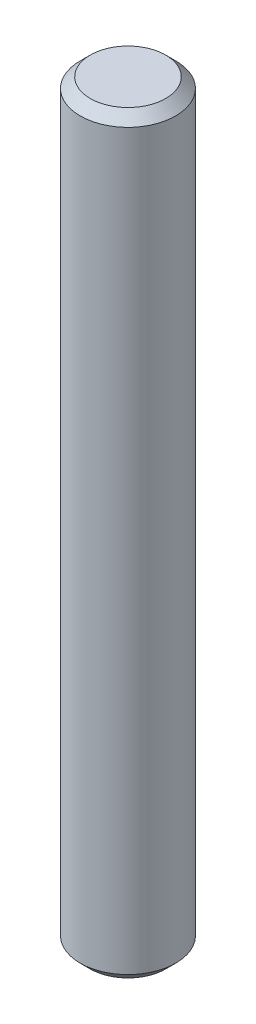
ISO-10303-21;
HEADER;
FILE_DESCRIPTION(('STEP AP214'),'2;1');
FILE_NAME('part.step','',(''),(''),'','','');
FILE_SCHEMA(('AUTOMOTIVE_DESIGN { 1 0 10303 214 1 1 1 1 }'));
ENDSEC;
DATA;
#1=APPLICATION_CONTEXT('core data for automotive mechanical design processes');
#2=APPLICATION_PROTOCOL_DEFINITION('international standard','automotive_design',2000,#1);
#3=PRODUCT_CONTEXT('',#1,'mechanical');
#4=PRODUCT('Part','Part','',(#3));
#5=PRODUCT_RELATED_PRODUCT_CATEGORY('part','',(#4));
#6=PRODUCT_DEFINITION_FORMATION('','',#4);
#7=PRODUCT_DEFINITION_CONTEXT('part definition',#1,'design');
#8=PRODUCT_DEFINITION('design','',#6,#7);
#9=PRODUCT_DEFINITION_SHAPE('','',#8);
#10=(LENGTH_UNIT() NAMED_UNIT(*) SI_UNIT(.MILLI.,.METRE.));
#11=(NAMED_UNIT(*) PLANE_ANGLE_UNIT() SI_UNIT($,.RADIAN.));
#12=(NAMED_UNIT(*) SI_UNIT($,.STERADIAN.) SOLID_ANGLE_UNIT());
#13=UNCERTAINTY_MEASURE_WITH_UNIT(LENGTH_MEASURE(1.E-05),#10,'distance_accuracy_value','');
#14=(GEOMETRIC_REPRESENTATION_CONTEXT(3) GLOBAL_UNCERTAINTY_ASSIGNED_CONTEXT((#13)) GLOBAL_UNIT_ASSIGNED_CONTEXT((#10,
#11,#12)) REPRESENTATION_CONTEXT('',''));
#15=CARTESIAN_POINT('',(0.,0.,0.));
#16=DIRECTION('',(0.,0.,1.));
#17=DIRECTION('',(1.,0.,0.));
#18=AXIS2_PLACEMENT_3D('',#15,#16,#17);
#19=CARTESIAN_POINT('',(0.,15.,0.));
#20=DIRECTION('',(0.,-1.,0.));
#21=DIRECTION('',(0.,0.,-1.));
#22=AXIS2_PLACEMENT_3D('',#19,#20,#21);
#23=CYLINDRICAL_SURFACE('',#22,0.95);
#24=CARTESIAN_POINT('',(0.,0.199999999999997,0.));
#25=DIRECTION('',(0.,1.,0.));
#26=DIRECTION('',(0.,0.,1.));
#27=AXIS2_PLACEMENT_3D('',#24,#25,#26);
#28=CIRCLE('',#27,0.95);
#29=CARTESIAN_POINT('',(0.,0.199999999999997,0.95));
#30=VERTEX_POINT('',#29);
#31=EDGE_CURVE('E55',#30,#30,#28,.T.);
#32=ORIENTED_EDGE('',*,*,#31,.T.);
#33=EDGE_LOOP('',(#32));
#34=FACE_BOUND('',#33,.T.);
#35=CARTESIAN_POINT('',(0.,14.8,0.));
#36=DIRECTION('',(0.,1.,0.));
#37=DIRECTION('',(0.,0.,1.));
#38=AXIS2_PLACEMENT_3D('',#35,#36,#37);
#39=CIRCLE('',#38,0.95);
#40=CARTESIAN_POINT('',(0.,14.8,0.95));
#41=VERTEX_POINT('',#40);
#42=EDGE_CURVE('E59',#41,#41,#39,.F.);
#43=ORIENTED_EDGE('',*,*,#42,.T.);
#44=EDGE_LOOP('',(#43));
#45=FACE_BOUND('',#44,.T.);
#46=ADVANCED_FACE('F43',(#34,#45),#23,.T.);
#47=CARTESIAN_POINT('',(0.,15.,0.));
#48=DIRECTION('',(0.,1.,0.));
#49=DIRECTION('',(0.,0.,1.));
#50=AXIS2_PLACEMENT_3D('',#47,#48,#49);
#51=PLANE('',#50);
#52=CARTESIAN_POINT('',(0.,15.,0.));
#53=DIRECTION('',(0.,1.,0.));
#54=DIRECTION('',(0.,0.,1.));
#55=AXIS2_PLACEMENT_3D('',#52,#53,#54);
#56=CIRCLE('',#55,0.749999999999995);
#57=CARTESIAN_POINT('',(0.,15.,0.749999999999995));
#58=VERTEX_POINT('',#57);
#59=EDGE_CURVE('E10',#58,#58,#56,.T.);
#60=ORIENTED_EDGE('',*,*,#59,.T.);
#61=EDGE_LOOP('',(#60));
#62=FACE_BOUND('',#61,.T.);
#63=ADVANCED_FACE('F75',(#62),#51,.T.);
#64=CARTESIAN_POINT('',(0.,0.,0.));
#65=DIRECTION('',(0.,1.,0.));
#66=DIRECTION('',(0.,0.,1.));
#67=AXIS2_PLACEMENT_3D('',#64,#65,#66);
#68=PLANE('',#67);
#69=CARTESIAN_POINT('',(0.,0.,0.));
#70=DIRECTION('',(0.,1.,0.));
#71=DIRECTION('',(0.,0.,1.));
#72=AXIS2_PLACEMENT_3D('',#69,#70,#71);
#73=CIRCLE('',#72,0.750000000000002);
#74=CARTESIAN_POINT('',(0.,0.,0.750000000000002));
#75=VERTEX_POINT('',#74);
#76=EDGE_CURVE('E51',#75,#75,#73,.F.);
#77=ORIENTED_EDGE('',*,*,#76,.T.);
#78=EDGE_LOOP('',(#77));
#79=FACE_BOUND('',#78,.T.);
#80=ADVANCED_FACE('F72',(#79),#68,.F.);
#81=CARTESIAN_POINT('',(0.,0.199999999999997,0.));
#82=DIRECTION('',(0.,1.,0.));
#83=DIRECTION('',(0.,0.,1.));
#84=AXIS2_PLACEMENT_3D('',#81,#82,#83);
#85=CONICAL_SURFACE('',#84,0.95,0.785398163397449);
#86=ORIENTED_EDGE('',*,*,#76,.F.);
#87=EDGE_LOOP('',(#86));
#88=FACE_BOUND('',#87,.T.);
#89=ORIENTED_EDGE('',*,*,#31,.F.);
#90=EDGE_LOOP('',(#89));
#91=FACE_BOUND('',#90,.T.);
#92=ADVANCED_FACE('F68',(#88,#91),#85,.T.);
#93=CARTESIAN_POINT('',(0.,15.,0.));
#94=DIRECTION('',(0.,-1.,0.));
#95=DIRECTION('',(0.,0.,-1.));
#96=AXIS2_PLACEMENT_3D('',#93,#94,#95);
#97=CONICAL_SURFACE('',#96,0.749999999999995,0.785398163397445);
#98=ORIENTED_EDGE('',*,*,#42,.F.);
#99=EDGE_LOOP('',(#98));
#100=FACE_BOUND('',#99,.T.);
#101=ORIENTED_EDGE('',*,*,#59,.F.);
#102=EDGE_LOOP('',(#101));
#103=FACE_BOUND('',#102,.T.);
#104=ADVANCED_FACE('F46',(#100,#103),#97,.T.);
#105=CLOSED_SHELL('',(#46,#63,#80,#92,#104));
#106=MANIFOLD_SOLID_BREP('B2',#105);
#107=ADVANCED_BREP_SHAPE_REPRESENTATION('',(#18,#106),#14);
#108=SHAPE_DEFINITION_REPRESENTATION(#9,#107);
ENDSEC;
END-ISO-10303-21;
